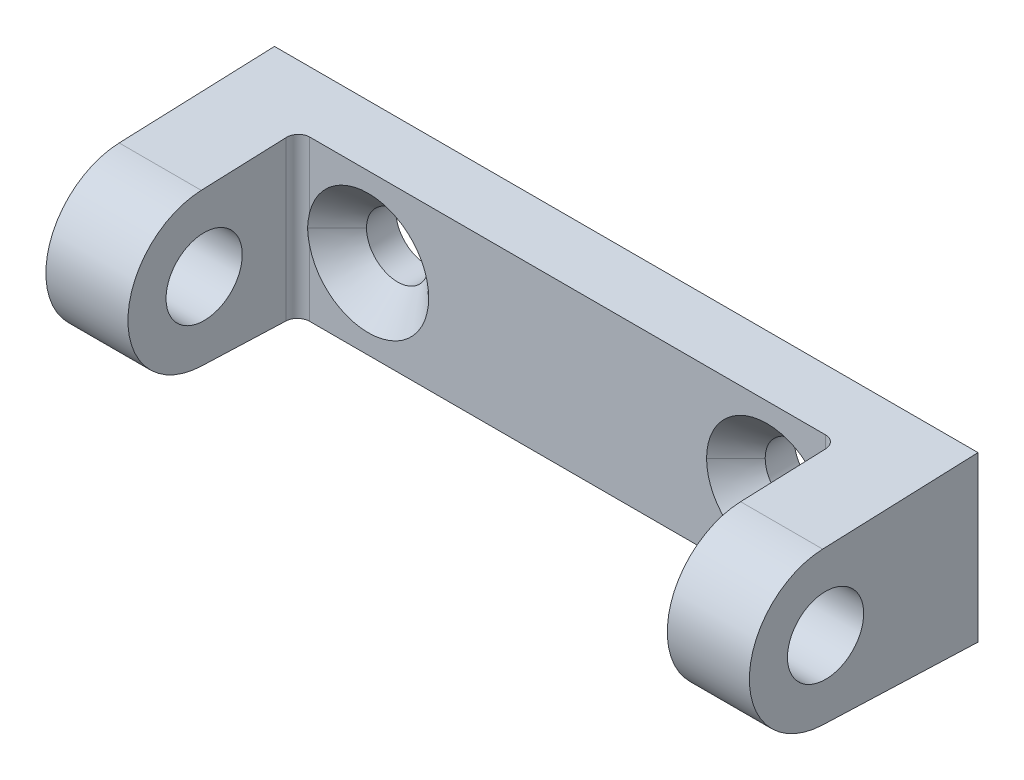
ISO-10303-21;
HEADER;
FILE_DESCRIPTION(('STEP AP214'),'2;1');
FILE_NAME('part.step','',(''),(''),'','','');
FILE_SCHEMA(('AUTOMOTIVE_DESIGN { 1 0 10303 214 1 1 1 1 }'));
ENDSEC;
DATA;
#1=APPLICATION_CONTEXT('core data for automotive mechanical design processes');
#2=APPLICATION_PROTOCOL_DEFINITION('international standard','automotive_design',2000,#1);
#3=PRODUCT_CONTEXT('',#1,'mechanical');
#4=PRODUCT('Part','Part','',(#3));
#5=PRODUCT_RELATED_PRODUCT_CATEGORY('part','',(#4));
#6=PRODUCT_DEFINITION_FORMATION('','',#4);
#7=PRODUCT_DEFINITION_CONTEXT('part definition',#1,'design');
#8=PRODUCT_DEFINITION('design','',#6,#7);
#9=PRODUCT_DEFINITION_SHAPE('','',#8);
#10=(LENGTH_UNIT() NAMED_UNIT(*) SI_UNIT(.MILLI.,.METRE.));
#11=(NAMED_UNIT(*) PLANE_ANGLE_UNIT() SI_UNIT($,.RADIAN.));
#12=(NAMED_UNIT(*) SI_UNIT($,.STERADIAN.) SOLID_ANGLE_UNIT());
#13=UNCERTAINTY_MEASURE_WITH_UNIT(LENGTH_MEASURE(1.E-05),#10,'distance_accuracy_value','');
#14=(GEOMETRIC_REPRESENTATION_CONTEXT(3) GLOBAL_UNCERTAINTY_ASSIGNED_CONTEXT((#13)) GLOBAL_UNIT_ASSIGNED_CONTEXT((#10,
#11,#12)) REPRESENTATION_CONTEXT('',''));
#15=CARTESIAN_POINT('',(0.,0.,0.));
#16=DIRECTION('',(0.,0.,1.));
#17=DIRECTION('',(1.,0.,0.));
#18=AXIS2_PLACEMENT_3D('',#15,#16,#17);
#19=CARTESIAN_POINT('',(0.,0.,5.25));
#20=DIRECTION('',(0.,0.,-1.));
#21=DIRECTION('',(1.,0.,0.));
#22=AXIS2_PLACEMENT_3D('',#19,#20,#21);
#23=CYLINDRICAL_SURFACE('',#22,2.65);
#24=CARTESIAN_POINT('',(0.,0.,0.));
#25=DIRECTION('',(0.,0.,-1.));
#26=DIRECTION('',(1.,0.,0.));
#27=AXIS2_PLACEMENT_3D('',#24,#25,#26);
#28=CIRCLE('',#27,2.65);
#29=CARTESIAN_POINT('',(2.65,0.,0.));
#30=VERTEX_POINT('',#29);
#31=EDGE_CURVE('E233',#30,#30,#28,.F.);
#32=ORIENTED_EDGE('',*,*,#31,.F.);
#33=EDGE_LOOP('',(#32));
#34=FACE_BOUND('',#33,.T.);
#35=CARTESIAN_POINT('',(0.,0.,2.5));
#36=DIRECTION('',(0.,0.,-1.));
#37=DIRECTION('',(1.,0.,0.));
#38=AXIS2_PLACEMENT_3D('',#35,#36,#37);
#39=CIRCLE('',#38,2.65);
#40=CARTESIAN_POINT('',(-2.6499999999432,0.,2.5000000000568));
#41=VERTEX_POINT('',#40);
#42=CARTESIAN_POINT('',(2.64999999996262,0.,2.4999999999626));
#43=VERTEX_POINT('',#42);
#44=EDGE_CURVE('E183',#41,#43,#39,.T.);
#45=ORIENTED_EDGE('',*,*,#44,.F.);
#46=CARTESIAN_POINT('',(0.,0.,2.5));
#47=DIRECTION('',(0.,0.,-1.));
#48=DIRECTION('',(1.,0.,0.));
#49=AXIS2_PLACEMENT_3D('',#46,#47,#48);
#50=CIRCLE('',#49,2.65);
#51=EDGE_CURVE('E176',#43,#41,#50,.T.);
#52=ORIENTED_EDGE('',*,*,#51,.F.);
#53=EDGE_LOOP('',(#45,#52));
#54=FACE_BOUND('',#53,.T.);
#55=ADVANCED_FACE('F14',(#34,#54),#23,.F.);
#56=CARTESIAN_POINT('',(34.,0.,5.25));
#57=DIRECTION('',(0.,0.,1.));
#58=DIRECTION('',(-1.,0.,0.));
#59=AXIS2_PLACEMENT_3D('',#56,#57,#58);
#60=CYLINDRICAL_SURFACE('',#59,2.65);
#61=CARTESIAN_POINT('',(34.,0.,0.));
#62=DIRECTION('',(0.,0.,1.));
#63=DIRECTION('',(-1.,0.,0.));
#64=AXIS2_PLACEMENT_3D('',#61,#62,#63);
#65=CIRCLE('',#64,2.65);
#66=CARTESIAN_POINT('',(31.35,0.,0.));
#67=VERTEX_POINT('',#66);
#68=EDGE_CURVE('E409',#67,#67,#65,.T.);
#69=ORIENTED_EDGE('',*,*,#68,.F.);
#70=EDGE_LOOP('',(#69));
#71=FACE_BOUND('',#70,.T.);
#72=CARTESIAN_POINT('',(34.,0.,2.5));
#73=DIRECTION('',(0.,0.,1.));
#74=DIRECTION('',(-1.,0.,0.));
#75=AXIS2_PLACEMENT_3D('',#72,#73,#74);
#76=CIRCLE('',#75,2.65);
#77=CARTESIAN_POINT('',(31.3500000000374,0.,2.4999999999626));
#78=VERTEX_POINT('',#77);
#79=CARTESIAN_POINT('',(36.6499999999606,0.,2.4999999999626));
#80=VERTEX_POINT('',#79);
#81=EDGE_CURVE('E207',#78,#80,#76,.F.);
#82=ORIENTED_EDGE('',*,*,#81,.F.);
#83=CARTESIAN_POINT('',(34.,0.,2.5));
#84=DIRECTION('',(0.,0.,1.));
#85=DIRECTION('',(-1.,0.,0.));
#86=AXIS2_PLACEMENT_3D('',#83,#84,#85);
#87=CIRCLE('',#86,2.65);
#88=EDGE_CURVE('E189',#80,#78,#87,.F.);
#89=ORIENTED_EDGE('',*,*,#88,.F.);
#90=EDGE_LOOP('',(#82,#89));
#91=FACE_BOUND('',#90,.T.);
#92=ADVANCED_FACE('F296',(#71,#91),#60,.F.);
#93=CARTESIAN_POINT('',(34.,0.,4.99999999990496));
#94=DIRECTION('',(0.,0.,1.));
#95=DIRECTION('',(-1.,0.,0.));
#96=AXIS2_PLACEMENT_3D('',#93,#94,#95);
#97=CONICAL_SURFACE('',#96,5.14999999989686,0.785398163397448);
#98=ORIENTED_EDGE('',*,*,#88,.T.);
#99=DIRECTION('',(0.707106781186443,0.,-0.707106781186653));
#100=VECTOR('',#99,1.);
#101=CARTESIAN_POINT('',(-498949.,2.76380325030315E-11,498982.850000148));
#102=LINE('',#101,#100);
#103=CARTESIAN_POINT('',(28.8499999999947,0.,5.00000000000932));
#104=VERTEX_POINT('',#103);
#105=EDGE_CURVE('E196',#78,#104,#102,.F.);
#106=ORIENTED_EDGE('',*,*,#105,.T.);
#107=CARTESIAN_POINT('',(34.,0.,5.));
#108=DIRECTION('',(0.,0.,-1.));
#109=DIRECTION('',(1.,0.,0.));
#110=AXIS2_PLACEMENT_3D('',#107,#108,#109);
#111=CIRCLE('',#110,5.1499999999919);
#112=CARTESIAN_POINT('',(39.0000042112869,-1.23385214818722,4.99999820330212));
#113=VERTEX_POINT('',#112);
#114=EDGE_CURVE('E241',#113,#104,#111,.T.);
#115=ORIENTED_EDGE('',*,*,#114,.F.);
#116=CARTESIAN_POINT('',(34.,0.,5.00000000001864));
#117=DIRECTION('',(0.,0.,1.));
#118=DIRECTION('',(-1.,0.,0.));
#119=AXIS2_PLACEMENT_3D('',#116,#117,#118);
#120=CIRCLE('',#119,5.15000000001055);
#121=CARTESIAN_POINT('',(39.1500000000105,0.,5.00000000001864));
#122=VERTEX_POINT('',#121);
#123=EDGE_CURVE('E204',#113,#122,#120,.T.);
#124=ORIENTED_EDGE('',*,*,#123,.T.);
#125=DIRECTION('',(-0.707106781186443,0.,-0.707106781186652));
#126=VECTOR('',#125,1.);
#127=CARTESIAN_POINT('',(499017.,-3.34697608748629E-11,498982.850000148));
#128=LINE('',#127,#126);
#129=EDGE_CURVE('E199',#122,#80,#128,.T.);
#130=ORIENTED_EDGE('',*,*,#129,.T.);
#131=EDGE_LOOP('',(#98,#106,#115,#124,#130));
#132=FACE_BOUND('',#131,.T.);
#133=ADVANCED_FACE('F280',(#132),#97,.F.);
#134=CARTESIAN_POINT('',(0.,0.,4.9999999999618));
#135=DIRECTION('',(0.,0.,1.));
#136=DIRECTION('',(-1.,0.,0.));
#137=AXIS2_PLACEMENT_3D('',#134,#135,#136);
#138=CONICAL_SURFACE('',#137,5.14999999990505,0.785398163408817);
#139=DIRECTION('',(-0.707106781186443,0.,-0.707106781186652));
#140=VECTOR('',#139,1.);
#141=CARTESIAN_POINT('',(499013.149999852,-3.34717832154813E-11,499013.));
#142=LINE('',#141,#140);
#143=CARTESIAN_POINT('',(5.149999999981,0.,5.00000000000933));
#144=VERTEX_POINT('',#143);
#145=EDGE_CURVE('E238',#144,#43,#142,.T.);
#146=ORIENTED_EDGE('',*,*,#145,.T.);
#147=ORIENTED_EDGE('',*,*,#51,.T.);
#148=DIRECTION('',(-0.707106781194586,0.,0.707106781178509));
#149=VECTOR('',#148,1.);
#150=CARTESIAN_POINT('',(-5.14999999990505,0.,4.99999999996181));
#151=LINE('',#150,#149);
#152=CARTESIAN_POINT('',(-5.14999459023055,0.,4.99999459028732));
#153=VERTEX_POINT('',#152);
#154=EDGE_CURVE('E351',#41,#153,#151,.T.);
#155=ORIENTED_EDGE('',*,*,#154,.T.);
#156=CARTESIAN_POINT('',(0.,0.,4.99999459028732));
#157=DIRECTION('',(0.,0.,1.));
#158=DIRECTION('',(-1.,0.,0.));
#159=AXIS2_PLACEMENT_3D('',#156,#157,#158);
#160=CIRCLE('',#159,5.14999459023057);
#161=CARTESIAN_POINT('',(-5.0000049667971,-1.23385233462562,4.99999879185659));
#162=VERTEX_POINT('',#161);
#163=EDGE_CURVE('E245',#153,#162,#160,.T.);
#164=ORIENTED_EDGE('',*,*,#163,.T.);
#165=CARTESIAN_POINT('',(0.,0.,5.00000000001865));
#166=DIRECTION('',(0.,0.,1.));
#167=DIRECTION('',(-1.,0.,0.));
#168=AXIS2_PLACEMENT_3D('',#165,#166,#167);
#169=CIRCLE('',#168,5.14999999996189);
#170=EDGE_CURVE('E346',#144,#162,#169,.F.);
#171=ORIENTED_EDGE('',*,*,#170,.F.);
#172=EDGE_LOOP('',(#146,#147,#155,#164,#171));
#173=FACE_BOUND('',#172,.T.);
#174=ADVANCED_FACE('F366',(#173),#138,.F.);
#175=CARTESIAN_POINT('',(0.,0.,5.02891362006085));
#176=DIRECTION('',(0.,0.,1.));
#177=DIRECTION('',(-1.,0.,0.));
#178=AXIS2_PLACEMENT_3D('',#175,#176,#177);
#179=CONICAL_SURFACE('',#178,5.17891362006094,0.785398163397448);
#180=ORIENTED_EDGE('',*,*,#145,.F.);
#181=CARTESIAN_POINT('',(0.,0.,5.));
#182=DIRECTION('',(0.,0.,-1.));
#183=DIRECTION('',(1.,0.,0.));
#184=AXIS2_PLACEMENT_3D('',#181,#182,#183);
#185=CIRCLE('',#184,5.15000000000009);
#186=CARTESIAN_POINT('',(-5.00000461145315,1.23383719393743,4.99999727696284));
#187=VERTEX_POINT('',#186);
#188=EDGE_CURVE('E240',#187,#144,#185,.T.);
#189=ORIENTED_EDGE('',*,*,#188,.F.);
#190=CARTESIAN_POINT('',(-5.0000140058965,1.23383951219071,5.00000000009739));
#191=CARTESIAN_POINT('',(-5.02511433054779,1.13213471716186,4.99999867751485));
#192=CARTESIAN_POINT('',(-5.04803815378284,1.02984318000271,5.00094956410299));
#193=CARTESIAN_POINT('',(-5.08849220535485,0.82404055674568,5.00371601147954));
#194=CARTESIAN_POINT('',(-5.10601334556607,0.720527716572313,5.00553301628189));
#195=CARTESIAN_POINT('',(-5.13428205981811,0.514387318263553,5.00895493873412));
#196=CARTESIAN_POINT('',(-5.14514222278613,0.411775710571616,5.01056299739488));
#197=CARTESIAN_POINT('',(-5.15972220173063,0.206109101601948,5.01280914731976));
#198=CARTESIAN_POINT('',(-5.16344805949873,0.103054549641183,5.01344805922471));
#199=CARTESIAN_POINT('',(-5.16344805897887,-0.103055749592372,5.01344805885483));
#200=CARTESIAN_POINT('',(-5.15972211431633,-0.20611149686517,5.01280913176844));
#201=CARTESIAN_POINT('',(-5.14514180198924,-0.411780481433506,5.01056293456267));
#202=CARTESIAN_POINT('',(-5.13428139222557,-0.514393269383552,5.00895484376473));
#203=CARTESIAN_POINT('',(-5.10601205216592,-0.720536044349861,5.00553287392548));
#204=CARTESIAN_POINT('',(-5.0884905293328,-0.824050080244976,5.00371585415));
#205=CARTESIAN_POINT('',(-5.048035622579,-1.02985506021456,5.00094943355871));
#206=CARTESIAN_POINT('',(-5.02511132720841,-1.13214775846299,4.99999858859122));
#207=CARTESIAN_POINT('',(-5.0000105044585,-1.23385370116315,5.00000000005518));
#208=B_SPLINE_CURVE_WITH_KNOTS('',3,(#190,#191,#192,#193,#194,#195,#196,#197,#198,#199,#200,
#201,#202,#203,#204,#205,#206,#207),.UNSPECIFIED.,.F.,.F.,(4,2,2,2,2,2,2,2,4),(0.,
0.314316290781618,0.629158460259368,0.938520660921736,1.2476207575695,1.55672443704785,
1.86609023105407,2.1809361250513,2.4952561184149),.UNSPECIFIED.);
#209=EDGE_CURVE('E135',#187,#162,#208,.T.);
#210=ORIENTED_EDGE('',*,*,#209,.T.);
#211=ORIENTED_EDGE('',*,*,#163,.F.);
#212=ORIENTED_EDGE('',*,*,#154,.F.);
#213=ORIENTED_EDGE('',*,*,#44,.T.);
#214=EDGE_LOOP('',(#180,#189,#210,#211,#212,#213));
#215=FACE_BOUND('',#214,.T.);
#216=ADVANCED_FACE('F278',(#215),#179,.F.);
#217=CARTESIAN_POINT('',(34.,0.,5.02891343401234));
#218=DIRECTION('',(0.,0.,1.));
#219=DIRECTION('',(-1.,0.,0.));
#220=AXIS2_PLACEMENT_3D('',#217,#218,#219);
#221=CONICAL_SURFACE('',#220,5.17891343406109,0.785398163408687);
#222=ORIENTED_EDGE('',*,*,#81,.T.);
#223=ORIENTED_EDGE('',*,*,#129,.F.);
#224=ORIENTED_EDGE('',*,*,#123,.F.);
#225=CARTESIAN_POINT('',(39.0000140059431,1.23383951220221,5.00000000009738));
#226=CARTESIAN_POINT('',(39.0248517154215,1.13319713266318,4.99999844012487));
#227=CARTESIAN_POINT('',(39.0475584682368,1.0319815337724,5.00092965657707));
#228=CARTESIAN_POINT('',(39.0877014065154,0.828356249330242,5.00364939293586));
#229=CARTESIAN_POINT('',(39.105128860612,0.725944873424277,5.00543932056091));
#230=CARTESIAN_POINT('',(39.1333704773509,0.521985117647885,5.00883208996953));
#231=CARTESIAN_POINT('',(39.1442934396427,0.420452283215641,5.01043762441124));
#232=CARTESIAN_POINT('',(39.1591663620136,0.216937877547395,5.01271838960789));
#233=CARTESIAN_POINT('',(39.1631220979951,0.114956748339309,5.01339439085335));
#234=CARTESIAN_POINT('',(39.1637413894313,-0.0911524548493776,5.01349631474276));
#235=CARTESIAN_POINT('',(39.1602514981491,-0.195281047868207,5.01289593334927));
#236=CARTESIAN_POINT('',(39.1459746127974,-0.403101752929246,5.01068671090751));
#237=CARTESIAN_POINT('',(39.135181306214,-0.50679340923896,5.00907699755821));
#238=CARTESIAN_POINT('',(39.106891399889,-0.715117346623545,5.00562686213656));
#239=CARTESIAN_POINT('',(39.0892783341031,-0.819733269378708,5.00378282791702));
#240=CARTESIAN_POINT('',(39.0485149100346,-1.02771631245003,5.00096956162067));
#241=CARTESIAN_POINT('',(39.0253740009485,-1.13108525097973,4.999998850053));
#242=CARTESIAN_POINT('',(39.0000105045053,-1.23385370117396,5.00000000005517));
#243=B_SPLINE_CURVE_WITH_KNOTS('',3,(#225,#226,#227,#228,#229,#230,#231,#232,#233,#234,#235,
#236,#237,#238,#239,#240,#241,#242),.UNSPECIFIED.,.F.,.F.,(4,2,2,2,2,2,2,2,4),(0.,
0.31103047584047,0.622572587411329,0.928745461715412,1.2346643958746,1.54694882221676,
1.85950350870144,2.17764972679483,2.49525595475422),.UNSPECIFIED.);
#244=CARTESIAN_POINT('',(39.0000046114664,1.2338371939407,4.99999727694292));
#245=VERTEX_POINT('',#244);
#246=EDGE_CURVE('E252',#245,#113,#243,.T.);
#247=ORIENTED_EDGE('',*,*,#246,.F.);
#248=CARTESIAN_POINT('',(34.,0.,5.));
#249=DIRECTION('',(0.,0.,-1.));
#250=DIRECTION('',(1.,0.,0.));
#251=AXIS2_PLACEMENT_3D('',#248,#249,#250);
#252=CIRCLE('',#251,5.1500000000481);
#253=EDGE_CURVE('E247',#104,#245,#252,.T.);
#254=ORIENTED_EDGE('',*,*,#253,.F.);
#255=ORIENTED_EDGE('',*,*,#105,.F.);
#256=EDGE_LOOP('',(#222,#223,#224,#247,#254,#255));
#257=FACE_BOUND('',#256,.T.);
#258=ADVANCED_FACE('F272',(#257),#221,.F.);
#259=CARTESIAN_POINT('',(-13.,0.,13.));
#260=DIRECTION('',(-1.,0.,0.));
#261=DIRECTION('',(0.,0.,-1.));
#262=AXIS2_PLACEMENT_3D('',#259,#260,#261);
#263=PLANE('',#262);
#264=CARTESIAN_POINT('',(-13.,0.,13.));
#265=DIRECTION('',(-1.,0.,0.));
#266=DIRECTION('',(0.,0.,-1.));
#267=AXIS2_PLACEMENT_3D('',#264,#265,#266);
#268=CIRCLE('',#267,3.25);
#269=CARTESIAN_POINT('',(-13.,0.,9.75));
#270=VERTEX_POINT('',#269);
#271=EDGE_CURVE('E316',#270,#270,#268,.T.);
#272=ORIENTED_EDGE('',*,*,#271,.F.);
#273=EDGE_LOOP('',(#272));
#274=FACE_BOUND('',#273,.T.);
#275=CARTESIAN_POINT('',(-13.,0.,13.));
#276=DIRECTION('',(-1.,0.,0.));
#277=DIRECTION('',(0.,0.,-1.));
#278=AXIS2_PLACEMENT_3D('',#275,#276,#277);
#279=CIRCLE('',#278,6.5);
#280=CARTESIAN_POINT('',(-13.,-6.49528769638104,13.2474626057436));
#281=VERTEX_POINT('',#280);
#282=CARTESIAN_POINT('',(-13.,6.49528769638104,13.2474626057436));
#283=VERTEX_POINT('',#282);
#284=EDGE_CURVE('E18',#281,#283,#279,.T.);
#285=ORIENTED_EDGE('',*,*,#284,.T.);
#286=DIRECTION('',(0.,0.0380711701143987,-0.999275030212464));
#287=VECTOR('',#286,1.);
#288=CARTESIAN_POINT('',(-13.,6.495287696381,13.2474626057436));
#289=LINE('',#288,#287);
#290=CARTESIAN_POINT('',(-13.,7.,0.));
#291=VERTEX_POINT('',#290);
#292=EDGE_CURVE('E235',#291,#283,#289,.F.);
#293=ORIENTED_EDGE('',*,*,#292,.F.);
#294=DIRECTION('',(0.,-1.,0.));
#295=VECTOR('',#294,1.);
#296=CARTESIAN_POINT('',(-13.,7.,0.));
#297=LINE('',#296,#295);
#298=CARTESIAN_POINT('',(-13.,-7.,0.));
#299=VERTEX_POINT('',#298);
#300=EDGE_CURVE('E227',#299,#291,#297,.F.);
#301=ORIENTED_EDGE('',*,*,#300,.F.);
#302=DIRECTION('',(0.,0.0380711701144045,0.999275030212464));
#303=VECTOR('',#302,1.);
#304=CARTESIAN_POINT('',(-13.,-7.,0.));
#305=LINE('',#304,#303);
#306=EDGE_CURVE('E148',#299,#281,#305,.T.);
#307=ORIENTED_EDGE('',*,*,#306,.T.);
#308=EDGE_LOOP('',(#285,#293,#301,#307));
#309=FACE_BOUND('',#308,.T.);
#310=ADVANCED_FACE('F277',(#274,#309),#263,.T.);
#311=CARTESIAN_POINT('',(47.,7.,0.));
#312=DIRECTION('',(0.,0.,-1.));
#313=DIRECTION('',(1.,0.,0.));
#314=AXIS2_PLACEMENT_3D('',#311,#312,#313);
#315=PLANE('',#314);
#316=ORIENTED_EDGE('',*,*,#68,.T.);
#317=EDGE_LOOP('',(#316));
#318=FACE_BOUND('',#317,.T.);
#319=ORIENTED_EDGE('',*,*,#31,.T.);
#320=EDGE_LOOP('',(#319));
#321=FACE_BOUND('',#320,.T.);
#322=DIRECTION('',(1.,0.,0.));
#323=VECTOR('',#322,1.);
#324=CARTESIAN_POINT('',(47.,7.,0.));
#325=LINE('',#324,#323);
#326=CARTESIAN_POINT('',(47.,7.,0.));
#327=VERTEX_POINT('',#326);
#328=EDGE_CURVE('E224',#291,#327,#325,.T.);
#329=ORIENTED_EDGE('',*,*,#328,.T.);
#330=DIRECTION('',(0.,-1.,0.));
#331=VECTOR('',#330,1.);
#332=CARTESIAN_POINT('',(47.,7.,0.));
#333=LINE('',#332,#331);
#334=CARTESIAN_POINT('',(47.,-7.,0.));
#335=VERTEX_POINT('',#334);
#336=EDGE_CURVE('E228',#327,#335,#333,.T.);
#337=ORIENTED_EDGE('',*,*,#336,.T.);
#338=DIRECTION('',(1.,0.,0.));
#339=VECTOR('',#338,1.);
#340=CARTESIAN_POINT('',(47.,-7.,0.));
#341=LINE('',#340,#339);
#342=EDGE_CURVE('E210',#335,#299,#341,.F.);
#343=ORIENTED_EDGE('',*,*,#342,.T.);
#344=ORIENTED_EDGE('',*,*,#300,.T.);
#345=EDGE_LOOP('',(#329,#337,#343,#344));
#346=FACE_BOUND('',#345,.T.);
#347=ADVANCED_FACE('F301',(#318,#321,#346),#315,.T.);
#348=CARTESIAN_POINT('',(-6.,-8.4,5.));
#349=DIRECTION('',(0.,0.,-1.));
#350=DIRECTION('',(1.,0.,0.));
#351=AXIS2_PLACEMENT_3D('',#348,#349,#350);
#352=PLANE('',#351);
#353=ORIENTED_EDGE('',*,*,#253,.T.);
#354=DIRECTION('',(0.,-1.,0.));
#355=VECTOR('',#354,1.);
#356=CARTESIAN_POINT('',(39.,-8.4,5.));
#357=LINE('',#356,#355);
#358=CARTESIAN_POINT('',(39.,6.80950604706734,5.));
#359=VERTEX_POINT('',#358);
#360=EDGE_CURVE('E338',#359,#245,#357,.T.);
#361=ORIENTED_EDGE('',*,*,#360,.F.);
#362=DIRECTION('',(-1.,0.,0.));
#363=VECTOR('',#362,1.);
#364=CARTESIAN_POINT('',(47.,6.80950604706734,5.));
#365=LINE('',#364,#363);
#366=CARTESIAN_POINT('',(-5.,6.80950604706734,5.));
#367=VERTEX_POINT('',#366);
#368=EDGE_CURVE('E164',#367,#359,#365,.F.);
#369=ORIENTED_EDGE('',*,*,#368,.F.);
#370=DIRECTION('',(0.,-1.,0.));
#371=VECTOR('',#370,1.);
#372=CARTESIAN_POINT('',(-5.,-8.4,5.));
#373=LINE('',#372,#371);
#374=EDGE_CURVE('E334',#187,#367,#373,.F.);
#375=ORIENTED_EDGE('',*,*,#374,.F.);
#376=ORIENTED_EDGE('',*,*,#188,.T.);
#377=ORIENTED_EDGE('',*,*,#170,.T.);
#378=DIRECTION('',(0.,-1.,0.));
#379=VECTOR('',#378,1.);
#380=CARTESIAN_POINT('',(-5.,-8.4,5.));
#381=LINE('',#380,#379);
#382=CARTESIAN_POINT('',(-5.,-6.80950604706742,5.));
#383=VERTEX_POINT('',#382);
#384=EDGE_CURVE('E330',#383,#162,#381,.F.);
#385=ORIENTED_EDGE('',*,*,#384,.F.);
#386=DIRECTION('',(-1.,0.,0.));
#387=VECTOR('',#386,1.);
#388=CARTESIAN_POINT('',(47.,-6.80950604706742,5.));
#389=LINE('',#388,#387);
#390=CARTESIAN_POINT('',(39.,-6.80950604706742,5.));
#391=VERTEX_POINT('',#390);
#392=EDGE_CURVE('E131',#391,#383,#389,.T.);
#393=ORIENTED_EDGE('',*,*,#392,.F.);
#394=DIRECTION('',(0.,-1.,0.));
#395=VECTOR('',#394,1.);
#396=CARTESIAN_POINT('',(39.,-8.4,5.));
#397=LINE('',#396,#395);
#398=EDGE_CURVE('E145',#113,#391,#397,.T.);
#399=ORIENTED_EDGE('',*,*,#398,.F.);
#400=ORIENTED_EDGE('',*,*,#114,.T.);
#401=EDGE_LOOP('',(#353,#361,#369,#375,#376,#377,#385,#393,#399,#400));
#402=FACE_BOUND('',#401,.T.);
#403=ADVANCED_FACE('F304',(#402),#352,.F.);
#404=CARTESIAN_POINT('',(-5.,-6.910629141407,6.));
#405=DIRECTION('',(0.,1.,0.));
#406=DIRECTION('',(0.,0.,-1.));
#407=AXIS2_PLACEMENT_3D('',#404,#405,#406);
#408=CYLINDRICAL_SURFACE('',#407,1.);
#409=DIRECTION('',(0.,-1.,0.));
#410=VECTOR('',#409,1.);
#411=CARTESIAN_POINT('',(-6.,-8.4,6.));
#412=LINE('',#411,#410);
#413=CARTESIAN_POINT('',(-6.,6.77140725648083,6.));
#414=VERTEX_POINT('',#413);
#415=CARTESIAN_POINT('',(-6.,-6.77140725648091,6.));
#416=VERTEX_POINT('',#415);
#417=EDGE_CURVE('E139',#414,#416,#412,.T.);
#418=ORIENTED_EDGE('',*,*,#417,.T.);
#419=CARTESIAN_POINT('',(-5.,-6.77140725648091,6.));
#420=DIRECTION('',(0.,-0.999275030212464,0.0380711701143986));
#421=DIRECTION('',(0.,0.0380711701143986,0.999275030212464));
#422=AXIS2_PLACEMENT_3D('',#419,#420,#421);
#423=ELLIPSE('',#422,1.00072549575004,1.);
#424=EDGE_CURVE('E124',#383,#416,#423,.F.);
#425=ORIENTED_EDGE('',*,*,#424,.F.);
#426=ORIENTED_EDGE('',*,*,#384,.T.);
#427=ORIENTED_EDGE('',*,*,#209,.F.);
#428=ORIENTED_EDGE('',*,*,#374,.T.);
#429=CARTESIAN_POINT('',(-5.,6.77140725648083,6.));
#430=DIRECTION('',(0.,0.999275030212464,0.0380711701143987));
#431=DIRECTION('',(0.,0.0380711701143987,-0.999275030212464));
#432=AXIS2_PLACEMENT_3D('',#429,#430,#431);
#433=ELLIPSE('',#432,1.00072549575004,1.);
#434=EDGE_CURVE('E136',#414,#367,#433,.F.);
#435=ORIENTED_EDGE('',*,*,#434,.F.);
#436=EDGE_LOOP('',(#418,#425,#426,#427,#428,#435));
#437=FACE_BOUND('',#436,.T.);
#438=ADVANCED_FACE('F140',(#437),#408,.F.);
#439=CARTESIAN_POINT('',(-6.,0.,13.));
#440=DIRECTION('',(-1.,0.,0.));
#441=DIRECTION('',(0.,0.,-1.));
#442=AXIS2_PLACEMENT_3D('',#439,#440,#441);
#443=CYLINDRICAL_SURFACE('',#442,6.5);
#444=DIRECTION('',(-1.,0.,0.));
#445=VECTOR('',#444,1.);
#446=CARTESIAN_POINT('',(47.,6.495287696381,13.2474626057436));
#447=LINE('',#446,#445);
#448=CARTESIAN_POINT('',(-6.,6.49528769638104,13.2474626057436));
#449=VERTEX_POINT('',#448);
#450=EDGE_CURVE('E32',#283,#449,#447,.F.);
#451=ORIENTED_EDGE('',*,*,#450,.F.);
#452=ORIENTED_EDGE('',*,*,#284,.F.);
#453=DIRECTION('',(-1.,0.,0.));
#454=VECTOR('',#453,1.);
#455=CARTESIAN_POINT('',(47.,-6.49528769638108,13.2474626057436));
#456=LINE('',#455,#454);
#457=CARTESIAN_POINT('',(-6.,-6.49528769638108,13.2474626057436));
#458=VERTEX_POINT('',#457);
#459=EDGE_CURVE('E200',#458,#281,#456,.T.);
#460=ORIENTED_EDGE('',*,*,#459,.F.);
#461=CARTESIAN_POINT('',(-6.,0.,13.));
#462=DIRECTION('',(-1.,0.,0.));
#463=DIRECTION('',(0.,0.,-1.));
#464=AXIS2_PLACEMENT_3D('',#461,#462,#463);
#465=CIRCLE('',#464,6.5);
#466=EDGE_CURVE('E9',#458,#449,#465,.T.);
#467=ORIENTED_EDGE('',*,*,#466,.T.);
#468=EDGE_LOOP('',(#451,#452,#460,#467));
#469=FACE_BOUND('',#468,.T.);
#470=ADVANCED_FACE('F16',(#469),#443,.T.);
#471=CARTESIAN_POINT('',(47.,-7.,0.));
#472=DIRECTION('',(0.,-0.999275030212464,0.0380711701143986));
#473=DIRECTION('',(0.,0.0380711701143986,0.999275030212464));
#474=AXIS2_PLACEMENT_3D('',#471,#472,#473);
#475=PLANE('',#474);
#476=ORIENTED_EDGE('',*,*,#424,.T.);
#477=DIRECTION('',(0.,0.0380711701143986,0.999275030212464));
#478=VECTOR('',#477,1.);
#479=CARTESIAN_POINT('',(-6.,-7.,0.));
#480=LINE('',#479,#478);
#481=EDGE_CURVE('E129',#416,#458,#480,.T.);
#482=ORIENTED_EDGE('',*,*,#481,.T.);
#483=ORIENTED_EDGE('',*,*,#459,.T.);
#484=ORIENTED_EDGE('',*,*,#306,.F.);
#485=ORIENTED_EDGE('',*,*,#342,.F.);
#486=DIRECTION('',(0.,0.0380711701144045,0.999275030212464));
#487=VECTOR('',#486,1.);
#488=CARTESIAN_POINT('',(47.,-7.,0.));
#489=LINE('',#488,#487);
#490=CARTESIAN_POINT('',(47.,-6.49528769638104,13.2474626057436));
#491=VERTEX_POINT('',#490);
#492=EDGE_CURVE('E167',#335,#491,#489,.T.);
#493=ORIENTED_EDGE('',*,*,#492,.T.);
#494=DIRECTION('',(-1.,0.,0.));
#495=VECTOR('',#494,1.);
#496=CARTESIAN_POINT('',(47.,-6.49528769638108,13.2474626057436));
#497=LINE('',#496,#495);
#498=CARTESIAN_POINT('',(40.,-6.49528769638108,13.2474626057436));
#499=VERTEX_POINT('',#498);
#500=EDGE_CURVE('E214',#491,#499,#497,.T.);
#501=ORIENTED_EDGE('',*,*,#500,.T.);
#502=DIRECTION('',(0.,0.0380711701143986,0.999275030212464));
#503=VECTOR('',#502,1.);
#504=CARTESIAN_POINT('',(40.,-7.,0.));
#505=LINE('',#504,#503);
#506=CARTESIAN_POINT('',(40.,-6.77140725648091,6.));
#507=VERTEX_POINT('',#506);
#508=EDGE_CURVE('E150',#499,#507,#505,.F.);
#509=ORIENTED_EDGE('',*,*,#508,.T.);
#510=CARTESIAN_POINT('',(39.,-6.77140725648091,6.));
#511=DIRECTION('',(0.,-0.999275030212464,0.0380711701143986));
#512=DIRECTION('',(0.,0.0380711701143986,0.999275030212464));
#513=AXIS2_PLACEMENT_3D('',#510,#511,#512);
#514=ELLIPSE('',#513,1.00072549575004,1.);
#515=EDGE_CURVE('E355',#507,#391,#514,.F.);
#516=ORIENTED_EDGE('',*,*,#515,.T.);
#517=ORIENTED_EDGE('',*,*,#392,.T.);
#518=EDGE_LOOP('',(#476,#482,#483,#484,#485,#493,#501,#509,#516,#517));
#519=FACE_BOUND('',#518,.T.);
#520=ADVANCED_FACE('F126',(#519),#475,.T.);
#521=CARTESIAN_POINT('',(39.,-6.910629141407,6.));
#522=DIRECTION('',(0.,1.,0.));
#523=DIRECTION('',(0.,0.,-1.));
#524=AXIS2_PLACEMENT_3D('',#521,#522,#523);
#525=CYLINDRICAL_SURFACE('',#524,1.);
#526=DIRECTION('',(0.,-1.,0.));
#527=VECTOR('',#526,1.);
#528=CARTESIAN_POINT('',(40.,-8.4,6.));
#529=LINE('',#528,#527);
#530=CARTESIAN_POINT('',(40.,6.77140725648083,6.));
#531=VERTEX_POINT('',#530);
#532=EDGE_CURVE('E144',#507,#531,#529,.F.);
#533=ORIENTED_EDGE('',*,*,#532,.T.);
#534=CARTESIAN_POINT('',(39.,6.77140725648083,6.));
#535=DIRECTION('',(0.,0.999275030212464,0.0380711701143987));
#536=DIRECTION('',(0.,0.0380711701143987,-0.999275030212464));
#537=AXIS2_PLACEMENT_3D('',#534,#535,#536);
#538=ELLIPSE('',#537,1.00072549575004,1.);
#539=EDGE_CURVE('E373',#359,#531,#538,.F.);
#540=ORIENTED_EDGE('',*,*,#539,.F.);
#541=ORIENTED_EDGE('',*,*,#360,.T.);
#542=ORIENTED_EDGE('',*,*,#246,.T.);
#543=ORIENTED_EDGE('',*,*,#398,.T.);
#544=ORIENTED_EDGE('',*,*,#515,.F.);
#545=EDGE_LOOP('',(#533,#540,#541,#542,#543,#544));
#546=FACE_BOUND('',#545,.T.);
#547=ADVANCED_FACE('F268',(#546),#525,.F.);
#548=CARTESIAN_POINT('',(-6.,0.,13.));
#549=DIRECTION('',(-1.,0.,0.));
#550=DIRECTION('',(0.,0.,-1.));
#551=AXIS2_PLACEMENT_3D('',#548,#549,#550);
#552=PLANE('',#551);
#553=CARTESIAN_POINT('',(-6.,0.,13.));
#554=DIRECTION('',(1.,0.,0.));
#555=DIRECTION('',(0.,0.,1.));
#556=AXIS2_PLACEMENT_3D('',#553,#554,#555);
#557=CIRCLE('',#556,3.25);
#558=CARTESIAN_POINT('',(-6.,0.,16.25));
#559=VERTEX_POINT('',#558);
#560=EDGE_CURVE('E401',#559,#559,#557,.T.);
#561=ORIENTED_EDGE('',*,*,#560,.F.);
#562=EDGE_LOOP('',(#561));
#563=FACE_BOUND('',#562,.T.);
#564=ORIENTED_EDGE('',*,*,#466,.F.);
#565=ORIENTED_EDGE('',*,*,#481,.F.);
#566=ORIENTED_EDGE('',*,*,#417,.F.);
#567=DIRECTION('',(0.,0.0380711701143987,-0.999275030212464));
#568=VECTOR('',#567,1.);
#569=CARTESIAN_POINT('',(-6.,6.495287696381,13.2474626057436));
#570=LINE('',#569,#568);
#571=EDGE_CURVE('E162',#449,#414,#570,.T.);
#572=ORIENTED_EDGE('',*,*,#571,.F.);
#573=EDGE_LOOP('',(#564,#565,#566,#572));
#574=FACE_BOUND('',#573,.T.);
#575=ADVANCED_FACE('F147',(#563,#574),#552,.F.);
#576=CARTESIAN_POINT('',(47.,6.495287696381,13.2474626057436));
#577=DIRECTION('',(0.,0.999275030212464,0.0380711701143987));
#578=DIRECTION('',(0.,0.0380711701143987,-0.999275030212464));
#579=AXIS2_PLACEMENT_3D('',#576,#577,#578);
#580=PLANE('',#579);
#581=ORIENTED_EDGE('',*,*,#434,.T.);
#582=ORIENTED_EDGE('',*,*,#368,.T.);
#583=ORIENTED_EDGE('',*,*,#539,.T.);
#584=DIRECTION('',(0.,0.0380711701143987,-0.999275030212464));
#585=VECTOR('',#584,1.);
#586=CARTESIAN_POINT('',(40.,6.495287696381,13.2474626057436));
#587=LINE('',#586,#585);
#588=CARTESIAN_POINT('',(40.,6.495287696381,13.2474626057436));
#589=VERTEX_POINT('',#588);
#590=EDGE_CURVE('E153',#531,#589,#587,.F.);
#591=ORIENTED_EDGE('',*,*,#590,.T.);
#592=DIRECTION('',(-1.,0.,0.));
#593=VECTOR('',#592,1.);
#594=CARTESIAN_POINT('',(47.,6.495287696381,13.2474626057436));
#595=LINE('',#594,#593);
#596=CARTESIAN_POINT('',(47.,6.495287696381,13.2474626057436));
#597=VERTEX_POINT('',#596);
#598=EDGE_CURVE('E161',#589,#597,#595,.F.);
#599=ORIENTED_EDGE('',*,*,#598,.T.);
#600=DIRECTION('',(0.,0.0380711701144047,-0.999275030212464));
#601=VECTOR('',#600,1.);
#602=CARTESIAN_POINT('',(47.,6.495287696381,13.2474626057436));
#603=LINE('',#602,#601);
#604=EDGE_CURVE('E175',#597,#327,#603,.T.);
#605=ORIENTED_EDGE('',*,*,#604,.T.);
#606=ORIENTED_EDGE('',*,*,#328,.F.);
#607=ORIENTED_EDGE('',*,*,#292,.T.);
#608=ORIENTED_EDGE('',*,*,#450,.T.);
#609=ORIENTED_EDGE('',*,*,#571,.T.);
#610=EDGE_LOOP('',(#581,#582,#583,#591,#599,#605,#606,#607,#608,#609));
#611=FACE_BOUND('',#610,.T.);
#612=ADVANCED_FACE('F284',(#611),#580,.T.);
#613=CARTESIAN_POINT('',(47.,0.,13.));
#614=DIRECTION('',(-1.,0.,0.));
#615=DIRECTION('',(0.,0.,-1.));
#616=AXIS2_PLACEMENT_3D('',#613,#614,#615);
#617=CYLINDRICAL_SURFACE('',#616,6.5);
#618=CARTESIAN_POINT('',(40.,0.,13.));
#619=DIRECTION('',(-1.,0.,0.));
#620=DIRECTION('',(0.,0.,-1.));
#621=AXIS2_PLACEMENT_3D('',#618,#619,#620);
#622=CIRCLE('',#621,6.5);
#623=EDGE_CURVE('E341',#589,#499,#622,.F.);
#624=ORIENTED_EDGE('',*,*,#623,.T.);
#625=ORIENTED_EDGE('',*,*,#500,.F.);
#626=CARTESIAN_POINT('',(47.,0.,13.));
#627=DIRECTION('',(-1.,0.,0.));
#628=DIRECTION('',(0.,0.,-1.));
#629=AXIS2_PLACEMENT_3D('',#626,#627,#628);
#630=CIRCLE('',#629,6.5);
#631=EDGE_CURVE('E172',#491,#597,#630,.T.);
#632=ORIENTED_EDGE('',*,*,#631,.T.);
#633=ORIENTED_EDGE('',*,*,#598,.F.);
#634=EDGE_LOOP('',(#624,#625,#632,#633));
#635=FACE_BOUND('',#634,.T.);
#636=ADVANCED_FACE('F287',(#635),#617,.T.);
#637=CARTESIAN_POINT('',(40.,-8.4,5.));
#638=DIRECTION('',(1.,0.,0.));
#639=DIRECTION('',(0.,0.,1.));
#640=AXIS2_PLACEMENT_3D('',#637,#638,#639);
#641=PLANE('',#640);
#642=ORIENTED_EDGE('',*,*,#623,.F.);
#643=ORIENTED_EDGE('',*,*,#590,.F.);
#644=ORIENTED_EDGE('',*,*,#532,.F.);
#645=ORIENTED_EDGE('',*,*,#508,.F.);
#646=EDGE_LOOP('',(#642,#643,#644,#645));
#647=FACE_BOUND('',#646,.T.);
#648=CARTESIAN_POINT('',(40.,0.,13.));
#649=DIRECTION('',(1.,0.,0.));
#650=DIRECTION('',(0.,0.,1.));
#651=AXIS2_PLACEMENT_3D('',#648,#649,#650);
#652=CIRCLE('',#651,3.25);
#653=CARTESIAN_POINT('',(40.,0.,16.25));
#654=VERTEX_POINT('',#653);
#655=EDGE_CURVE('E383',#654,#654,#652,.F.);
#656=ORIENTED_EDGE('',*,*,#655,.F.);
#657=EDGE_LOOP('',(#656));
#658=FACE_BOUND('',#657,.T.);
#659=ADVANCED_FACE('F292',(#647,#658),#641,.F.);
#660=CARTESIAN_POINT('',(47.,0.,13.));
#661=DIRECTION('',(-1.,0.,0.));
#662=DIRECTION('',(0.,0.,-1.));
#663=AXIS2_PLACEMENT_3D('',#660,#661,#662);
#664=PLANE('',#663);
#665=ORIENTED_EDGE('',*,*,#631,.F.);
#666=ORIENTED_EDGE('',*,*,#492,.F.);
#667=ORIENTED_EDGE('',*,*,#336,.F.);
#668=ORIENTED_EDGE('',*,*,#604,.F.);
#669=EDGE_LOOP('',(#665,#666,#667,#668));
#670=FACE_BOUND('',#669,.T.);
#671=CARTESIAN_POINT('',(47.,0.,13.));
#672=DIRECTION('',(1.,0.,0.));
#673=DIRECTION('',(0.,0.,1.));
#674=AXIS2_PLACEMENT_3D('',#671,#672,#673);
#675=CIRCLE('',#674,3.25);
#676=CARTESIAN_POINT('',(47.,0.,16.25));
#677=VERTEX_POINT('',#676);
#678=EDGE_CURVE('E403',#677,#677,#675,.T.);
#679=ORIENTED_EDGE('',*,*,#678,.F.);
#680=EDGE_LOOP('',(#679));
#681=FACE_BOUND('',#680,.T.);
#682=ADVANCED_FACE('F288',(#670,#681),#664,.F.);
#683=CARTESIAN_POINT('',(28.794658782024,0.,13.));
#684=DIRECTION('',(1.,0.,0.));
#685=DIRECTION('',(0.,0.,1.));
#686=AXIS2_PLACEMENT_3D('',#683,#684,#685);
#687=CYLINDRICAL_SURFACE('',#686,3.25);
#688=ORIENTED_EDGE('',*,*,#655,.T.);
#689=EDGE_LOOP('',(#688));
#690=FACE_BOUND('',#689,.T.);
#691=ORIENTED_EDGE('',*,*,#678,.T.);
#692=EDGE_LOOP('',(#691));
#693=FACE_BOUND('',#692,.T.);
#694=ADVANCED_FACE('F291',(#690,#693),#687,.F.);
#695=CARTESIAN_POINT('',(-16.,0.,13.));
#696=DIRECTION('',(1.,0.,0.));
#697=DIRECTION('',(0.,0.,1.));
#698=AXIS2_PLACEMENT_3D('',#695,#696,#697);
#699=CYLINDRICAL_SURFACE('',#698,3.25);
#700=ORIENTED_EDGE('',*,*,#271,.T.);
#701=EDGE_LOOP('',(#700));
#702=FACE_BOUND('',#701,.T.);
#703=ORIENTED_EDGE('',*,*,#560,.T.);
#704=EDGE_LOOP('',(#703));
#705=FACE_BOUND('',#704,.T.);
#706=ADVANCED_FACE('F392',(#702,#705),#699,.F.);
#707=CLOSED_SHELL('',(#55,#92,#133,#174,#216,#258,#310,#347,#403,#438,#470,#520,#547,#575,#612,
#636,#659,#682,#694,#706));
#708=MANIFOLD_SOLID_BREP('B1',#707);
#709=ADVANCED_BREP_SHAPE_REPRESENTATION('',(#18,#708),#14);
#710=SHAPE_DEFINITION_REPRESENTATION(#9,#709);
ENDSEC;
END-ISO-10303-21;
